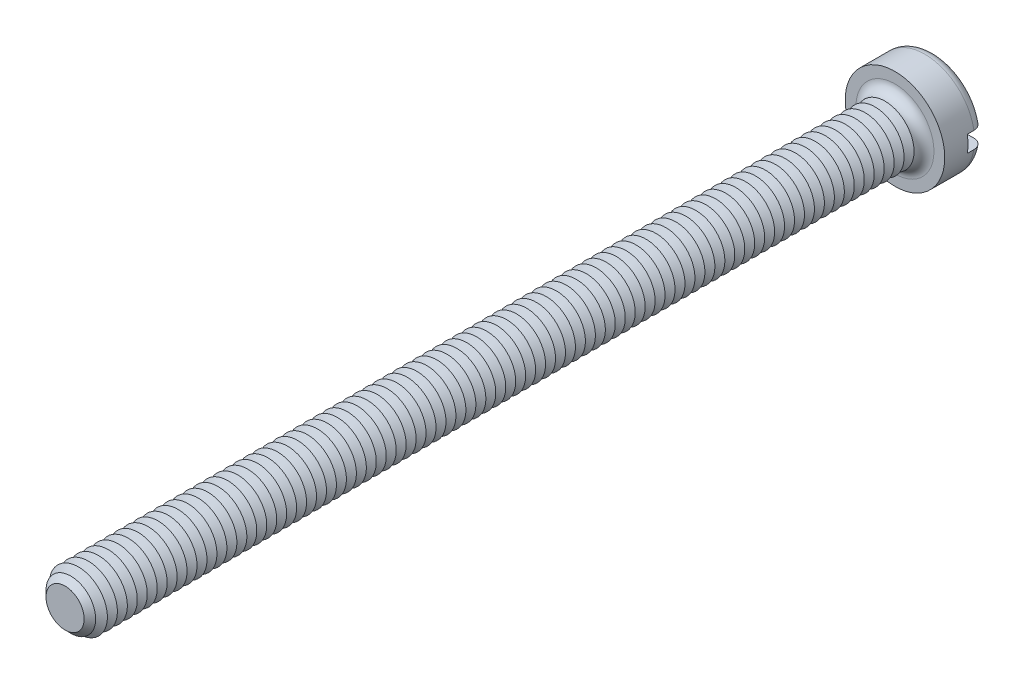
from build123d import *

# Parameters (mm, degrees)
SKETCH3_R           = 3
BOSS_EXTRUDE2_DEPTH = 2.4
SKETCH4_R           = 1.75
BOSS_EXTRUDE3_DEPTH = 50
FILLET1_R           = 0.6
CHAMFER1_SIZE       = 0.6
LPATTERN1_COUNT     = 82
LPATTERN1_PITCH     = 0.6
SKETCH8_W           = 6
SKETCH8_H           = 1
CUT_EXTRUDE1_DEPTH  = 1


with BuildPart() as part:
    # Sketch3 → Boss-Extrude2 (new body)
    with BuildSketch(Plane.XY):
        Circle(SKETCH3_R)
    extrude(amount=-BOSS_EXTRUDE2_DEPTH)

    # Sketch4 → Boss-Extrude3 (add)
    with BuildSketch(Plane.XY):
        Circle(SKETCH4_R)
    extrude(amount=BOSS_EXTRUDE3_DEPTH)

    # Fillet1
    fillet1_edges = [part.edges().sort_by_distance(p)[0] for p in [
        (-3, 0, -2.4),
        (-1.75, 0, 0),
    ]]
    fillet(fillet1_edges, radius=FILLET1_R)

    # Chamfer1
    chamfer1_edges = [part.edges().sort_by_distance(p)[0] for p in [
        (-1.75, 0, 50),
    ]]
    chamfer(chamfer1_edges, length=CHAMFER1_SIZE)

    # Sketch6 → Cut-Revolve1 (revolve, cut)
    with BuildSketch(Plane(origin=(0, 0, 0), x_dir=(0, 0, -1), z_dir=(1, 0, 0)), mode=Mode.PRIVATE) as cut_revolve1_sk:
        Polygon((-0.6, 1.75), (-0.9, 1.230384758), (-1.2, 1.75), align=None)
    cut_revolve1 = revolve(cut_revolve1_sk.sketch.rotate(Axis((0, 0, -1.694361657), (0, 0, 1)), 90), axis=Axis((0, 0, -1.694361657), (0, 0, 1)), mode=Mode.SUBTRACT)

    # LPattern1: Cut-Revolve1 ×82
    with Locations(*[(0, 0, i * LPATTERN1_PITCH) for i in range(1, LPATTERN1_COUNT)]):
        add(cut_revolve1, mode=Mode.SUBTRACT)

    # Sketch8 → Cut-Extrude1 (cut)
    with BuildSketch(Plane(origin=(0, 0, -2.4), x_dir=(-1, 0, 0), z_dir=(0, 0, -1))):
        Rectangle(SKETCH8_W, SKETCH8_H)
    extrude(amount=-CUT_EXTRUDE1_DEPTH, mode=Mode.SUBTRACT)


solid = part.part
